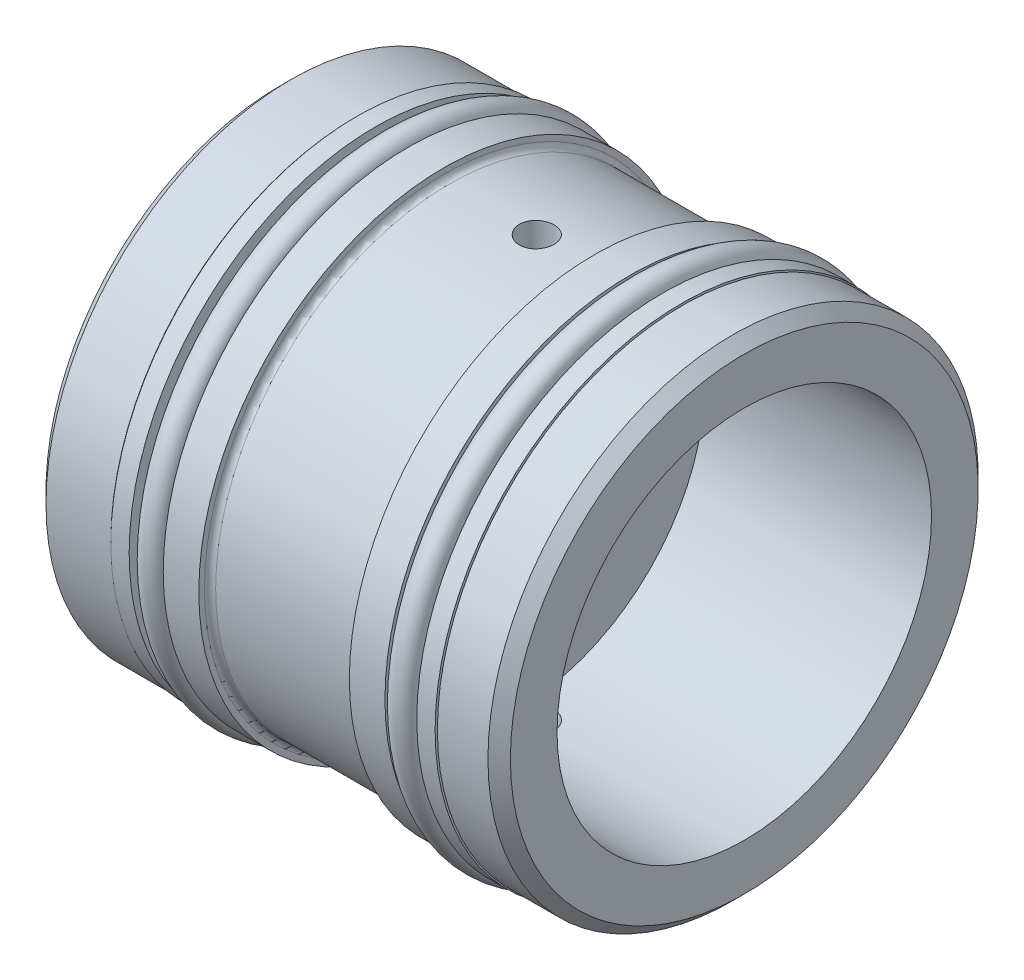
ISO-10303-21;
HEADER;
FILE_DESCRIPTION(('STEP AP214'),'2;1');
FILE_NAME('part.step','',(''),(''),'','','');
FILE_SCHEMA(('AUTOMOTIVE_DESIGN { 1 0 10303 214 1 1 1 1 }'));
ENDSEC;
DATA;
#1=APPLICATION_CONTEXT('core data for automotive mechanical design processes');
#2=APPLICATION_PROTOCOL_DEFINITION('international standard','automotive_design',2000,#1);
#3=PRODUCT_CONTEXT('',#1,'mechanical');
#4=PRODUCT('Part','Part','',(#3));
#5=PRODUCT_RELATED_PRODUCT_CATEGORY('part','',(#4));
#6=PRODUCT_DEFINITION_FORMATION('','',#4);
#7=PRODUCT_DEFINITION_CONTEXT('part definition',#1,'design');
#8=PRODUCT_DEFINITION('design','',#6,#7);
#9=PRODUCT_DEFINITION_SHAPE('','',#8);
#10=(LENGTH_UNIT() NAMED_UNIT(*) SI_UNIT(.MILLI.,.METRE.));
#11=(NAMED_UNIT(*) PLANE_ANGLE_UNIT() SI_UNIT($,.RADIAN.));
#12=(NAMED_UNIT(*) SI_UNIT($,.STERADIAN.) SOLID_ANGLE_UNIT());
#13=UNCERTAINTY_MEASURE_WITH_UNIT(LENGTH_MEASURE(1.E-05),#10,'distance_accuracy_value','');
#14=(GEOMETRIC_REPRESENTATION_CONTEXT(3) GLOBAL_UNCERTAINTY_ASSIGNED_CONTEXT((#13)) GLOBAL_UNIT_ASSIGNED_CONTEXT((#10,
#11,#12)) REPRESENTATION_CONTEXT('',''));
#15=CARTESIAN_POINT('',(0.,0.,0.));
#16=DIRECTION('',(0.,0.,1.));
#17=DIRECTION('',(1.,0.,0.));
#18=AXIS2_PLACEMENT_3D('',#15,#16,#17);
#19=CARTESIAN_POINT('',(0.,0.,0.));
#20=DIRECTION('',(-1.,0.,0.));
#21=DIRECTION('',(0.,0.,1.));
#22=AXIS2_PLACEMENT_3D('',#19,#20,#21);
#23=CYLINDRICAL_SURFACE('',#22,15.3543);
#24=CARTESIAN_POINT('',(9.32630715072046,0.,0.));
#25=DIRECTION('',(-1.,0.,0.));
#26=DIRECTION('',(0.,0.,1.));
#27=AXIS2_PLACEMENT_3D('',#24,#25,#26);
#28=CIRCLE('',#27,15.3543);
#29=CARTESIAN_POINT('',(9.32630715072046,0.,15.3543));
#30=VERTEX_POINT('',#29);
#31=EDGE_CURVE('E146',#30,#30,#28,.T.);
#32=ORIENTED_EDGE('',*,*,#31,.F.);
#33=EDGE_LOOP('',(#32));
#34=FACE_BOUND('',#33,.T.);
#35=CARTESIAN_POINT('',(10.2362,0.,0.));
#36=DIRECTION('',(1.,0.,0.));
#37=DIRECTION('',(0.,0.,-1.));
#38=AXIS2_PLACEMENT_3D('',#35,#36,#37);
#39=CIRCLE('',#38,15.3543);
#40=CARTESIAN_POINT('',(10.2362,0.,-15.3543));
#41=VERTEX_POINT('',#40);
#42=EDGE_CURVE('E10',#41,#41,#39,.T.);
#43=ORIENTED_EDGE('',*,*,#42,.F.);
#44=EDGE_LOOP('',(#43));
#45=FACE_BOUND('',#44,.T.);
#46=ADVANCED_FACE('F31',(#34,#45),#23,.T.);
#47=CARTESIAN_POINT('',(11.557,0.,0.));
#48=DIRECTION('',(-1.,0.,0.));
#49=DIRECTION('',(0.,0.,1.));
#50=AXIS2_PLACEMENT_3D('',#47,#48,#49);
#51=CIRCLE('',#50,15.3543);
#52=CARTESIAN_POINT('',(11.557,0.,15.3543));
#53=VERTEX_POINT('',#52);
#54=EDGE_CURVE('E198',#53,#53,#51,.T.);
#55=ORIENTED_EDGE('',*,*,#54,.T.);
#56=EDGE_LOOP('',(#55));
#57=FACE_BOUND('',#56,.T.);
#58=CARTESIAN_POINT('',(11.4808,0.,0.));
#59=DIRECTION('',(-1.,0.,0.));
#60=DIRECTION('',(0.,0.,1.));
#61=AXIS2_PLACEMENT_3D('',#58,#59,#60);
#62=CIRCLE('',#61,15.3543);
#63=CARTESIAN_POINT('',(11.4808,0.,15.3543));
#64=VERTEX_POINT('',#63);
#65=EDGE_CURVE('E43',#64,#64,#62,.T.);
#66=ORIENTED_EDGE('',*,*,#65,.F.);
#67=EDGE_LOOP('',(#66));
#68=FACE_BOUND('',#67,.T.);
#69=ADVANCED_FACE('F118',(#57,#68),#23,.T.);
#70=CARTESIAN_POINT('',(8.001,0.,0.));
#71=DIRECTION('',(-1.,0.,0.));
#72=DIRECTION('',(0.,0.,1.));
#73=AXIS2_PLACEMENT_3D('',#70,#71,#72);
#74=CIRCLE('',#73,15.3543);
#75=CARTESIAN_POINT('',(8.001,0.,15.3543));
#76=VERTEX_POINT('',#75);
#77=EDGE_CURVE('E142',#76,#76,#74,.T.);
#78=ORIENTED_EDGE('',*,*,#77,.F.);
#79=EDGE_LOOP('',(#78));
#80=FACE_BOUND('',#79,.T.);
#81=CARTESIAN_POINT('',(8.60609284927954,0.,0.));
#82=DIRECTION('',(1.,0.,0.));
#83=DIRECTION('',(0.,0.,-1.));
#84=AXIS2_PLACEMENT_3D('',#81,#82,#83);
#85=CIRCLE('',#84,15.3543);
#86=CARTESIAN_POINT('',(8.60609284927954,0.,-15.3543));
#87=VERTEX_POINT('',#86);
#88=EDGE_CURVE('E48',#87,#87,#85,.T.);
#89=ORIENTED_EDGE('',*,*,#88,.F.);
#90=EDGE_LOOP('',(#89));
#91=FACE_BOUND('',#90,.T.);
#92=ADVANCED_FACE('F121',(#80,#91),#23,.T.);
#93=CARTESIAN_POINT('',(0.,0.,0.));
#94=DIRECTION('',(-1.,0.,0.));
#95=DIRECTION('',(0.,0.,1.));
#96=AXIS2_PLACEMENT_3D('',#93,#94,#95);
#97=CYLINDRICAL_SURFACE('',#96,15.3543);
#98=CARTESIAN_POINT('',(-9.271,0.,0.));
#99=DIRECTION('',(-1.,0.,0.));
#100=DIRECTION('',(0.,0.,1.));
#101=AXIS2_PLACEMENT_3D('',#98,#99,#100);
#102=CIRCLE('',#101,15.3543);
#103=CARTESIAN_POINT('',(-9.271,0.,15.3543));
#104=VERTEX_POINT('',#103);
#105=EDGE_CURVE('E159',#104,#104,#102,.T.);
#106=ORIENTED_EDGE('',*,*,#105,.F.);
#107=EDGE_LOOP('',(#106));
#108=FACE_BOUND('',#107,.T.);
#109=CARTESIAN_POINT('',(-8.36110715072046,0.,0.));
#110=DIRECTION('',(1.,0.,0.));
#111=DIRECTION('',(0.,0.,-1.));
#112=AXIS2_PLACEMENT_3D('',#109,#110,#111);
#113=CIRCLE('',#112,15.3543);
#114=CARTESIAN_POINT('',(-8.36110715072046,0.,-15.3543));
#115=VERTEX_POINT('',#114);
#116=EDGE_CURVE('E148',#115,#115,#113,.T.);
#117=ORIENTED_EDGE('',*,*,#116,.F.);
#118=EDGE_LOOP('',(#117));
#119=FACE_BOUND('',#118,.T.);
#120=ADVANCED_FACE('F131',(#108,#119),#97,.T.);
#121=CARTESIAN_POINT('',(-7.0358,0.,0.));
#122=DIRECTION('',(-1.,0.,0.));
#123=DIRECTION('',(0.,0.,1.));
#124=AXIS2_PLACEMENT_3D('',#121,#122,#123);
#125=CIRCLE('',#124,15.3543);
#126=CARTESIAN_POINT('',(-7.0358,0.,15.3543));
#127=VERTEX_POINT('',#126);
#128=EDGE_CURVE('E214',#127,#127,#125,.T.);
#129=ORIENTED_EDGE('',*,*,#128,.T.);
#130=EDGE_LOOP('',(#129));
#131=FACE_BOUND('',#130,.T.);
#132=CARTESIAN_POINT('',(-7.64089284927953,0.,0.));
#133=DIRECTION('',(-1.,0.,0.));
#134=DIRECTION('',(0.,0.,1.));
#135=AXIS2_PLACEMENT_3D('',#132,#133,#134);
#136=CIRCLE('',#135,15.3543);
#137=CARTESIAN_POINT('',(-7.64089284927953,0.,15.3543));
#138=VERTEX_POINT('',#137);
#139=EDGE_CURVE('E153',#138,#138,#136,.T.);
#140=ORIENTED_EDGE('',*,*,#139,.F.);
#141=EDGE_LOOP('',(#140));
#142=FACE_BOUND('',#141,.T.);
#143=ADVANCED_FACE('F136',(#131,#142),#97,.T.);
#144=CARTESIAN_POINT('',(-10.5918,0.,0.));
#145=DIRECTION('',(-1.,0.,0.));
#146=DIRECTION('',(0.,0.,1.));
#147=AXIS2_PLACEMENT_3D('',#144,#145,#146);
#148=CIRCLE('',#147,15.3543);
#149=CARTESIAN_POINT('',(-10.5918,0.,15.3543));
#150=VERTEX_POINT('',#149);
#151=EDGE_CURVE('E217',#150,#150,#148,.T.);
#152=ORIENTED_EDGE('',*,*,#151,.F.);
#153=EDGE_LOOP('',(#152));
#154=FACE_BOUND('',#153,.T.);
#155=CARTESIAN_POINT('',(-10.5156,0.,0.));
#156=DIRECTION('',(1.,0.,0.));
#157=DIRECTION('',(0.,0.,-1.));
#158=AXIS2_PLACEMENT_3D('',#155,#156,#157);
#159=CIRCLE('',#158,15.3543);
#160=CARTESIAN_POINT('',(-10.5156,0.,-15.3543));
#161=VERTEX_POINT('',#160);
#162=EDGE_CURVE('E156',#161,#161,#159,.T.);
#163=ORIENTED_EDGE('',*,*,#162,.F.);
#164=EDGE_LOOP('',(#163));
#165=FACE_BOUND('',#164,.T.);
#166=ADVANCED_FACE('F97',(#154,#165),#97,.T.);
#167=CARTESIAN_POINT('',(0.,0.,0.));
#168=DIRECTION('',(-1.,0.,0.));
#169=DIRECTION('',(0.,0.,1.));
#170=AXIS2_PLACEMENT_3D('',#167,#168,#169);
#171=CYLINDRICAL_SURFACE('',#170,6.35);
#172=CARTESIAN_POINT('',(0.355599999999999,0.,0.));
#173=DIRECTION('',(-1.,0.,0.));
#174=DIRECTION('',(0.,0.,1.));
#175=AXIS2_PLACEMENT_3D('',#172,#173,#174);
#176=CIRCLE('',#175,6.35);
#177=CARTESIAN_POINT('',(0.355599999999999,0.,6.35));
#178=VERTEX_POINT('',#177);
#179=EDGE_CURVE('E186',#178,#178,#176,.T.);
#180=ORIENTED_EDGE('',*,*,#179,.F.);
#181=EDGE_LOOP('',(#180));
#182=FACE_BOUND('',#181,.T.);
#183=CARTESIAN_POINT('',(-15.748,0.,0.));
#184=DIRECTION('',(-1.,0.,0.));
#185=DIRECTION('',(0.,0.,1.));
#186=AXIS2_PLACEMENT_3D('',#183,#184,#185);
#187=CIRCLE('',#186,6.35);
#188=CARTESIAN_POINT('',(-15.748,0.,6.35));
#189=VERTEX_POINT('',#188);
#190=EDGE_CURVE('E223',#189,#189,#187,.T.);
#191=ORIENTED_EDGE('',*,*,#190,.T.);
#192=EDGE_LOOP('',(#191));
#193=FACE_BOUND('',#192,.T.);
#194=ADVANCED_FACE('F93',(#182,#193),#171,.F.);
#195=CARTESIAN_POINT('',(0.355599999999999,6.35,0.));
#196=DIRECTION('',(-1.,0.,0.));
#197=DIRECTION('',(0.,0.,1.));
#198=AXIS2_PLACEMENT_3D('',#195,#196,#197);
#199=PLANE('',#198);
#200=CARTESIAN_POINT('',(0.355599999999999,0.,0.));
#201=DIRECTION('',(-1.,0.,0.));
#202=DIRECTION('',(0.,0.,1.));
#203=AXIS2_PLACEMENT_3D('',#200,#201,#202);
#204=CIRCLE('',#203,12.7);
#205=CARTESIAN_POINT('',(0.355599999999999,0.,12.7));
#206=VERTEX_POINT('',#205);
#207=EDGE_CURVE('E189',#206,#206,#204,.T.);
#208=ORIENTED_EDGE('',*,*,#207,.F.);
#209=EDGE_LOOP('',(#208));
#210=FACE_BOUND('',#209,.T.);
#211=ORIENTED_EDGE('',*,*,#179,.T.);
#212=EDGE_LOOP('',(#211));
#213=FACE_BOUND('',#212,.T.);
#214=ADVANCED_FACE('F87',(#210,#213),#199,.F.);
#215=CARTESIAN_POINT('',(0.,0.,0.));
#216=DIRECTION('',(-1.,0.,0.));
#217=DIRECTION('',(0.,0.,1.));
#218=AXIS2_PLACEMENT_3D('',#215,#216,#217);
#219=CYLINDRICAL_SURFACE('',#218,12.7);
#220=CARTESIAN_POINT('',(1.6764,-12.644959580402,1.1811));
#221=CARTESIAN_POINT('',(1.61021118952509,-12.6449603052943,1.18109712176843));
#222=CARTESIAN_POINT('',(1.54397804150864,-12.6454848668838,1.17551744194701));
#223=CARTESIAN_POINT('',(1.41334642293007,-12.6475262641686,1.15334235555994));
#224=CARTESIAN_POINT('',(1.34895008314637,-12.6490442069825,1.13673465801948));
#225=CARTESIAN_POINT('',(1.22390284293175,-12.6528989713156,1.09298985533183));
#226=CARTESIAN_POINT('',(1.1632497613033,-12.6552353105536,1.06585895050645));
#227=CARTESIAN_POINT('',(1.0473720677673,-12.6604630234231,1.0018494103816));
#228=CARTESIAN_POINT('',(0.992146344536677,-12.6633542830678,0.964972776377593));
#229=CARTESIAN_POINT('',(0.88850261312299,-12.6693763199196,0.882392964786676));
#230=CARTESIAN_POINT('',(0.840104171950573,-12.6725077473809,0.836665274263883));
#231=CARTESIAN_POINT('',(0.751657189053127,-12.6786513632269,0.737733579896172));
#232=CARTESIAN_POINT('',(0.711609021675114,-12.6816635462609,0.684529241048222));
#233=CARTESIAN_POINT('',(0.640932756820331,-12.687235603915,0.572035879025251));
#234=CARTESIAN_POINT('',(0.610321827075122,-12.6897946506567,0.512736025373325));
#235=CARTESIAN_POINT('',(0.559498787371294,-12.6941650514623,0.389810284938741));
#236=CARTESIAN_POINT('',(0.539286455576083,-12.6959764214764,0.326184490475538));
#237=CARTESIAN_POINT('',(0.509891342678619,-12.6986428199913,0.196609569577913));
#238=CARTESIAN_POINT('',(0.50067660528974,-12.6995006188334,0.130667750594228));
#239=CARTESIAN_POINT('',(0.493439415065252,-12.7001726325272,-0.00183171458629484));
#240=CARTESIAN_POINT('',(0.495416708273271,-12.6999868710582,-0.0683893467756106));
#241=CARTESIAN_POINT('',(0.510481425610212,-12.6985949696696,-0.200014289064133));
#242=CARTESIAN_POINT('',(0.523534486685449,-12.6973919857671,-0.265085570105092));
#243=CARTESIAN_POINT('',(0.560326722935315,-12.6941045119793,-0.392109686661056));
#244=CARTESIAN_POINT('',(0.584066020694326,-12.6920200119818,-0.454062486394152));
#245=CARTESIAN_POINT('',(0.641594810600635,-12.6871984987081,-0.573199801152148));
#246=CARTESIAN_POINT('',(0.675399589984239,-12.6844604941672,-0.630376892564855));
#247=CARTESIAN_POINT('',(0.752088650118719,-12.6786394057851,-0.738258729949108));
#248=CARTESIAN_POINT('',(0.794973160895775,-12.6755563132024,-0.788963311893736));
#249=CARTESIAN_POINT('',(0.888797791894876,-12.6693774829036,-0.882661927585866));
#250=CARTESIAN_POINT('',(0.939767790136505,-12.6662817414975,-0.925626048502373));
#251=CARTESIAN_POINT('',(1.04821271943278,-12.6604382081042,-1.00239277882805));
#252=CARTESIAN_POINT('',(1.1056876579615,-12.6576904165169,-1.03619537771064));
#253=CARTESIAN_POINT('',(1.2255330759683,-12.6528535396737,-1.09367894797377));
#254=CARTESIAN_POINT('',(1.28790438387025,-12.6507645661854,-1.11735820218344));
#255=CARTESIAN_POINT('',(1.41576128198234,-12.6474841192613,-1.15389991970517));
#256=CARTESIAN_POINT('',(1.48124679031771,-12.6462926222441,-1.16676266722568));
#257=CARTESIAN_POINT('',(1.61321097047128,-12.6449460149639,-1.18126803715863));
#258=CARTESIAN_POINT('',(1.67968501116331,-12.644787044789,-1.18295244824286));
#259=CARTESIAN_POINT('',(1.81196957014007,-12.6455133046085,-1.17516295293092));
#260=CARTESIAN_POINT('',(1.87778009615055,-12.6463985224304,-1.16568917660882));
#261=CARTESIAN_POINT('',(2.00674851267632,-12.6491099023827,-1.1358871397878));
#262=CARTESIAN_POINT('',(2.06991098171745,-12.6509343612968,-1.11557852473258));
#263=CARTESIAN_POINT('',(2.1919324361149,-12.655317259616,-1.0647033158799));
#264=CARTESIAN_POINT('',(2.25079133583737,-12.6578757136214,-1.03413651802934));
#265=CARTESIAN_POINT('',(2.36272567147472,-12.6634476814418,-0.963507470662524));
#266=CARTESIAN_POINT('',(2.41578352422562,-12.6664625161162,-0.923417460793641));
#267=CARTESIAN_POINT('',(2.51443160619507,-12.6726031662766,-0.834919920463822));
#268=CARTESIAN_POINT('',(2.56002167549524,-12.6757289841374,-0.786512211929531));
#269=CARTESIAN_POINT('',(2.64258351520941,-12.6817509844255,-0.682572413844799));
#270=CARTESIAN_POINT('',(2.67952807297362,-12.6846464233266,-0.627018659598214));
#271=CARTESIAN_POINT('',(2.74356315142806,-12.6898706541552,-0.510471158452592));
#272=CARTESIAN_POINT('',(2.77065379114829,-12.6921994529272,-0.449477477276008));
#273=CARTESIAN_POINT('',(2.81416564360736,-12.6960246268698,-0.323877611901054));
#274=CARTESIAN_POINT('',(2.83060346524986,-12.6975222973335,-0.25927722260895));
#275=CARTESIAN_POINT('',(2.85239731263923,-12.6995217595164,-0.1282188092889));
#276=CARTESIAN_POINT('',(2.85775360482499,-12.7000235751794,-0.0617608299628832));
#277=CARTESIAN_POINT('',(2.85722888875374,-12.6999747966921,0.0708585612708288));
#278=CARTESIAN_POINT('',(2.85139019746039,-12.6994281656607,0.137020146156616));
#279=CARTESIAN_POINT('',(2.82872977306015,-12.6973517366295,0.267418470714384));
#280=CARTESIAN_POINT('',(2.81190802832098,-12.6958219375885,0.331655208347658));
#281=CARTESIAN_POINT('',(2.76777031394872,-12.6919506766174,0.456381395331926));
#282=CARTESIAN_POINT('',(2.74045537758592,-12.6896092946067,0.516871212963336));
#283=CARTESIAN_POINT('',(2.67611127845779,-12.6843762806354,0.632413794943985));
#284=CARTESIAN_POINT('',(2.63908221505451,-12.6814846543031,0.687466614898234));
#285=CARTESIAN_POINT('',(2.5562020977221,-12.675462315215,0.79078926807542));
#286=CARTESIAN_POINT('',(2.51031959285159,-12.6723307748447,0.839033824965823));
#287=CARTESIAN_POINT('',(2.41109523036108,-12.6661885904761,0.927158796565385));
#288=CARTESIAN_POINT('',(2.35775157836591,-12.6631779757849,0.967037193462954));
#289=CARTESIAN_POINT('',(2.24499082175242,-12.6576112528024,1.0373661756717));
#290=CARTESIAN_POINT('',(2.18556036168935,-12.6550561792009,1.06779541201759));
#291=CARTESIAN_POINT('',(2.06244889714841,-12.650702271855,1.11820304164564));
#292=CARTESIAN_POINT('',(1.99877282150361,-12.6489025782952,1.13819332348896));
#293=CARTESIAN_POINT('',(1.89167449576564,-12.6467210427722,1.16212349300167));
#294=CARTESIAN_POINT('',(1.84893882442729,-12.6460635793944,1.16923007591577));
#295=CARTESIAN_POINT('',(1.76294175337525,-12.6451826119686,1.1787192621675));
#296=CARTESIAN_POINT('',(1.71968035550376,-12.6449591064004,1.18110188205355));
#297=CARTESIAN_POINT('',(1.6764,-12.644959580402,1.1811));
#298=B_SPLINE_CURVE_WITH_KNOTS('',3,(#220,#221,#222,#223,#224,#225,#226,#227,#228,#229,#230,
#231,#232,#233,#234,#235,#236,#237,#238,#239,#240,#241,#242,#243,#244,#245,#246,#247,#248,#249,
#250,#251,#252,#253,#254,#255,#256,#257,#258,#259,#260,#261,#262,#263,#264,#265,#266,#267,#268,
#269,#270,#271,#272,#273,#274,#275,#276,#277,#278,#279,#280,#281,#282,#283,#284,#285,#286,#287,
#288,#289,#290,#291,#292,#293,#294,#295,#296,#297),.UNSPECIFIED.,.T.,.F.,(4,2,2,2,2,2,2,2,2,2,2,
2,2,2,2,2,2,2,2,2,2,2,2,2,2,2,2,2,2,2,2,2,2,2,2,2,2,2,4),(0.,0.198408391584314,
0.397038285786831,0.595551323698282,0.794023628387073,0.993053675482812,1.19209264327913,
1.39149158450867,1.5908862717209,1.78970014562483,1.98850950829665,2.18670430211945,
2.38490136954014,2.58340100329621,2.78190566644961,2.98116171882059,3.18041800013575,
3.37970806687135,3.57899289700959,3.7775323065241,3.97606940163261,4.17424773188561,
4.3724300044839,4.57119722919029,4.76996870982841,4.96935767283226,5.16874422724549,
5.36781916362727,5.56688931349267,5.76520846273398,5.96352782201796,6.16182765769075,
6.36012546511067,6.55914112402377,6.75820472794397,6.95771486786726,7.15699729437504,
7.28673547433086,7.41647319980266),.UNSPECIFIED.);
#299=CARTESIAN_POINT('',(1.6764,-12.644959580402,1.1811));
#300=VERTEX_POINT('',#299);
#301=EDGE_CURVE('E77',#300,#300,#298,.T.);
#302=ORIENTED_EDGE('',*,*,#301,.T.);
#303=EDGE_LOOP('',(#302));
#304=FACE_BOUND('',#303,.T.);
#305=CARTESIAN_POINT('',(1.6764,12.644959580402,1.1811));
#306=CARTESIAN_POINT('',(1.7425888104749,12.6449603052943,1.18109712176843));
#307=CARTESIAN_POINT('',(1.80882195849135,12.6454848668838,1.17551744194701));
#308=CARTESIAN_POINT('',(1.93945357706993,12.6475262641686,1.15334235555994));
#309=CARTESIAN_POINT('',(2.00384991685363,12.6490442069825,1.13673465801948));
#310=CARTESIAN_POINT('',(2.12889715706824,12.6528989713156,1.09298985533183));
#311=CARTESIAN_POINT('',(2.1895502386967,12.6552353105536,1.06585895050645));
#312=CARTESIAN_POINT('',(2.3054279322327,12.6604630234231,1.0018494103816));
#313=CARTESIAN_POINT('',(2.36065365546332,12.6633542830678,0.964972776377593));
#314=CARTESIAN_POINT('',(2.46429738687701,12.6693763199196,0.882392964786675));
#315=CARTESIAN_POINT('',(2.51269582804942,12.6725077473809,0.836665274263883));
#316=CARTESIAN_POINT('',(2.60114281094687,12.6786513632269,0.737733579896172));
#317=CARTESIAN_POINT('',(2.64119097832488,12.6816635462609,0.684529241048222));
#318=CARTESIAN_POINT('',(2.71186724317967,12.687235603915,0.572035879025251));
#319=CARTESIAN_POINT('',(2.74247817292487,12.6897946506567,0.512736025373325));
#320=CARTESIAN_POINT('',(2.7933012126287,12.6941650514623,0.38981028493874));
#321=CARTESIAN_POINT('',(2.81351354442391,12.6959764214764,0.326184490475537));
#322=CARTESIAN_POINT('',(2.84290865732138,12.6986428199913,0.196609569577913));
#323=CARTESIAN_POINT('',(2.85212339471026,12.6995006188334,0.130667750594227));
#324=CARTESIAN_POINT('',(2.85936058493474,12.7001726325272,-0.0018317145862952));
#325=CARTESIAN_POINT('',(2.85738329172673,12.6999868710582,-0.068389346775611));
#326=CARTESIAN_POINT('',(2.84231857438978,12.6985949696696,-0.200014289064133));
#327=CARTESIAN_POINT('',(2.82926551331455,12.6973919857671,-0.265085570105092));
#328=CARTESIAN_POINT('',(2.79247327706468,12.6941045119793,-0.392109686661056));
#329=CARTESIAN_POINT('',(2.76873397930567,12.6920200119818,-0.454062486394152));
#330=CARTESIAN_POINT('',(2.71120518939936,12.6871984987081,-0.573199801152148));
#331=CARTESIAN_POINT('',(2.67740041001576,12.6844604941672,-0.630376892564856));
#332=CARTESIAN_POINT('',(2.60071134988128,12.6786394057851,-0.738258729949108));
#333=CARTESIAN_POINT('',(2.55782683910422,12.6755563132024,-0.788963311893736));
#334=CARTESIAN_POINT('',(2.46400220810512,12.6693774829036,-0.882661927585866));
#335=CARTESIAN_POINT('',(2.41303220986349,12.6662817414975,-0.925626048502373));
#336=CARTESIAN_POINT('',(2.30458728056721,12.6604382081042,-1.00239277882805));
#337=CARTESIAN_POINT('',(2.2471123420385,12.6576904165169,-1.03619537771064));
#338=CARTESIAN_POINT('',(2.1272669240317,12.6528535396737,-1.09367894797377));
#339=CARTESIAN_POINT('',(2.06489561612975,12.6507645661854,-1.11735820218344));
#340=CARTESIAN_POINT('',(1.93703871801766,12.6474841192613,-1.15389991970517));
#341=CARTESIAN_POINT('',(1.87155320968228,12.6462926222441,-1.16676266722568));
#342=CARTESIAN_POINT('',(1.73958902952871,12.6449460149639,-1.18126803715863));
#343=CARTESIAN_POINT('',(1.67311498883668,12.644787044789,-1.18295244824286));
#344=CARTESIAN_POINT('',(1.54083042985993,12.6455133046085,-1.17516295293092));
#345=CARTESIAN_POINT('',(1.47501990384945,12.6463985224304,-1.16568917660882));
#346=CARTESIAN_POINT('',(1.34605148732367,12.6491099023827,-1.1358871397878));
#347=CARTESIAN_POINT('',(1.28288901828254,12.6509343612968,-1.11557852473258));
#348=CARTESIAN_POINT('',(1.1608675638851,12.655317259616,-1.0647033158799));
#349=CARTESIAN_POINT('',(1.10200866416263,12.6578757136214,-1.03413651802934));
#350=CARTESIAN_POINT('',(0.990074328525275,12.6634476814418,-0.963507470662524));
#351=CARTESIAN_POINT('',(0.937016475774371,12.6664625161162,-0.92341746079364));
#352=CARTESIAN_POINT('',(0.838368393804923,12.6726031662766,-0.834919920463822));
#353=CARTESIAN_POINT('',(0.792778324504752,12.6757289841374,-0.786512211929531));
#354=CARTESIAN_POINT('',(0.71021648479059,12.6817509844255,-0.682572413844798));
#355=CARTESIAN_POINT('',(0.67327192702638,12.6846464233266,-0.627018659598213));
#356=CARTESIAN_POINT('',(0.609236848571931,12.6898706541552,-0.510471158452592));
#357=CARTESIAN_POINT('',(0.582146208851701,12.6921994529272,-0.449477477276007));
#358=CARTESIAN_POINT('',(0.538634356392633,12.6960246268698,-0.323877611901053));
#359=CARTESIAN_POINT('',(0.522196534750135,12.6975222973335,-0.259277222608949));
#360=CARTESIAN_POINT('',(0.50040268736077,12.6995217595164,-0.1282188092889));
#361=CARTESIAN_POINT('',(0.49504639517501,12.7000235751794,-0.0617608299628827));
#362=CARTESIAN_POINT('',(0.495571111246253,12.6999747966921,0.070858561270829));
#363=CARTESIAN_POINT('',(0.501409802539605,12.6994281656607,0.137020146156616));
#364=CARTESIAN_POINT('',(0.524070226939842,12.6973517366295,0.267418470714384));
#365=CARTESIAN_POINT('',(0.540891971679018,12.6958219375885,0.331655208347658));
#366=CARTESIAN_POINT('',(0.585029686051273,12.6919506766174,0.456381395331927));
#367=CARTESIAN_POINT('',(0.61234462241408,12.6896092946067,0.516871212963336));
#368=CARTESIAN_POINT('',(0.676688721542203,12.6843762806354,0.632413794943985));
#369=CARTESIAN_POINT('',(0.71371778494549,12.6814846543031,0.687466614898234));
#370=CARTESIAN_POINT('',(0.796597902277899,12.675462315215,0.79078926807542));
#371=CARTESIAN_POINT('',(0.842480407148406,12.6723307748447,0.839033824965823));
#372=CARTESIAN_POINT('',(0.941704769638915,12.6661885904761,0.927158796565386));
#373=CARTESIAN_POINT('',(0.995048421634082,12.6631779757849,0.967037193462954));
#374=CARTESIAN_POINT('',(1.10780917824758,12.6576112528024,1.0373661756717));
#375=CARTESIAN_POINT('',(1.16723963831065,12.6550561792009,1.06779541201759));
#376=CARTESIAN_POINT('',(1.29035110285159,12.650702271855,1.11820304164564));
#377=CARTESIAN_POINT('',(1.35402717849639,12.6489025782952,1.13819332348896));
#378=CARTESIAN_POINT('',(1.46112550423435,12.6467210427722,1.16212349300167));
#379=CARTESIAN_POINT('',(1.50386117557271,12.6460635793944,1.16923007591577));
#380=CARTESIAN_POINT('',(1.58985824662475,12.6451826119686,1.1787192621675));
#381=CARTESIAN_POINT('',(1.63311964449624,12.6449591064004,1.18110188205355));
#382=CARTESIAN_POINT('',(1.6764,12.644959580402,1.1811));
#383=B_SPLINE_CURVE_WITH_KNOTS('',3,(#305,#306,#307,#308,#309,#310,#311,#312,#313,#314,#315,
#316,#317,#318,#319,#320,#321,#322,#323,#324,#325,#326,#327,#328,#329,#330,#331,#332,#333,#334,
#335,#336,#337,#338,#339,#340,#341,#342,#343,#344,#345,#346,#347,#348,#349,#350,#351,#352,#353,
#354,#355,#356,#357,#358,#359,#360,#361,#362,#363,#364,#365,#366,#367,#368,#369,#370,#371,#372,
#373,#374,#375,#376,#377,#378,#379,#380,#381,#382),.UNSPECIFIED.,.T.,.F.,(4,2,2,2,2,2,2,2,2,2,2,
2,2,2,2,2,2,2,2,2,2,2,2,2,2,2,2,2,2,2,2,2,2,2,2,2,2,2,4),(0.,0.198408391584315,
0.397038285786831,0.595551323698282,0.794023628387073,0.993053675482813,1.19209264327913,
1.39149158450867,1.5908862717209,1.78970014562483,1.98850950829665,2.18670430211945,
2.38490136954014,2.58340100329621,2.78190566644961,2.98116171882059,3.18041800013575,
3.37970806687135,3.57899289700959,3.7775323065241,3.97606940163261,4.17424773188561,
4.3724300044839,4.57119722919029,4.76996870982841,4.96935767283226,5.16874422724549,
5.36781916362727,5.56688931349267,5.76520846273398,5.96352782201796,6.16182765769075,
6.36012546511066,6.55914112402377,6.75820472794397,6.95771486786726,7.15699729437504,
7.28673547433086,7.41647319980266),.UNSPECIFIED.);
#384=CARTESIAN_POINT('',(1.6764,12.644959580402,1.1811));
#385=VERTEX_POINT('',#384);
#386=EDGE_CURVE('E72',#385,#385,#383,.T.);
#387=ORIENTED_EDGE('',*,*,#386,.T.);
#388=EDGE_LOOP('',(#387));
#389=FACE_BOUND('',#388,.T.);
#390=CARTESIAN_POINT('',(15.748,0.,0.));
#391=DIRECTION('',(-1.,0.,0.));
#392=DIRECTION('',(0.,0.,1.));
#393=AXIS2_PLACEMENT_3D('',#390,#391,#392);
#394=CIRCLE('',#393,12.7);
#395=CARTESIAN_POINT('',(15.748,0.,12.7));
#396=VERTEX_POINT('',#395);
#397=EDGE_CURVE('E192',#396,#396,#394,.T.);
#398=ORIENTED_EDGE('',*,*,#397,.F.);
#399=EDGE_LOOP('',(#398));
#400=FACE_BOUND('',#399,.T.);
#401=ORIENTED_EDGE('',*,*,#207,.T.);
#402=EDGE_LOOP('',(#401));
#403=FACE_BOUND('',#402,.T.);
#404=ADVANCED_FACE('F81',(#304,#389,#400,#403),#219,.F.);
#405=CARTESIAN_POINT('',(15.748,16.6243,0.));
#406=DIRECTION('',(-1.,0.,0.));
#407=DIRECTION('',(0.,0.,1.));
#408=AXIS2_PLACEMENT_3D('',#405,#406,#407);
#409=PLANE('',#408);
#410=CARTESIAN_POINT('',(15.748,0.,0.));
#411=DIRECTION('',(-1.,0.,0.));
#412=DIRECTION('',(0.,0.,1.));
#413=AXIS2_PLACEMENT_3D('',#410,#411,#412);
#414=CIRCLE('',#413,15.8623);
#415=CARTESIAN_POINT('',(15.748,0.,15.8623));
#416=VERTEX_POINT('',#415);
#417=EDGE_CURVE('E168',#416,#416,#414,.F.);
#418=ORIENTED_EDGE('',*,*,#417,.T.);
#419=EDGE_LOOP('',(#418));
#420=FACE_BOUND('',#419,.T.);
#421=ORIENTED_EDGE('',*,*,#397,.T.);
#422=EDGE_LOOP('',(#421));
#423=FACE_BOUND('',#422,.T.);
#424=ADVANCED_FACE('F86',(#420,#423),#409,.F.);
#425=CARTESIAN_POINT('',(0.,0.,0.));
#426=DIRECTION('',(-1.,0.,0.));
#427=DIRECTION('',(0.,0.,1.));
#428=AXIS2_PLACEMENT_3D('',#425,#426,#427);
#429=CYLINDRICAL_SURFACE('',#428,16.6243);
#430=CARTESIAN_POINT('',(14.986,0.,0.));
#431=DIRECTION('',(-1.,0.,0.));
#432=DIRECTION('',(0.,0.,1.));
#433=AXIS2_PLACEMENT_3D('',#430,#431,#432);
#434=CIRCLE('',#433,16.6243);
#435=CARTESIAN_POINT('',(14.986,0.,16.6243));
#436=VERTEX_POINT('',#435);
#437=EDGE_CURVE('E171',#436,#436,#434,.T.);
#438=ORIENTED_EDGE('',*,*,#437,.T.);
#439=EDGE_LOOP('',(#438));
#440=FACE_BOUND('',#439,.T.);
#441=CARTESIAN_POINT('',(11.557,0.,0.));
#442=DIRECTION('',(-1.,0.,0.));
#443=DIRECTION('',(0.,0.,1.));
#444=AXIS2_PLACEMENT_3D('',#441,#442,#443);
#445=CIRCLE('',#444,16.6243);
#446=CARTESIAN_POINT('',(11.557,0.,16.6243));
#447=VERTEX_POINT('',#446);
#448=EDGE_CURVE('E195',#447,#447,#445,.T.);
#449=ORIENTED_EDGE('',*,*,#448,.F.);
#450=EDGE_LOOP('',(#449));
#451=FACE_BOUND('',#450,.T.);
#452=ADVANCED_FACE('F418',(#440,#451),#429,.T.);
#453=CARTESIAN_POINT('',(11.557,16.6243,0.));
#454=DIRECTION('',(1.,0.,0.));
#455=DIRECTION('',(0.,0.,-1.));
#456=AXIS2_PLACEMENT_3D('',#453,#454,#455);
#457=PLANE('',#456);
#458=ORIENTED_EDGE('',*,*,#54,.F.);
#459=EDGE_LOOP('',(#458));
#460=FACE_BOUND('',#459,.T.);
#461=ORIENTED_EDGE('',*,*,#448,.T.);
#462=EDGE_LOOP('',(#461));
#463=FACE_BOUND('',#462,.T.);
#464=ADVANCED_FACE('F426',(#460,#463),#457,.F.);
#465=CARTESIAN_POINT('',(8.001,15.3543,0.));
#466=DIRECTION('',(-1.,0.,0.));
#467=DIRECTION('',(0.,0.,1.));
#468=AXIS2_PLACEMENT_3D('',#465,#466,#467);
#469=PLANE('',#468);
#470=CARTESIAN_POINT('',(8.001,0.,0.));
#471=DIRECTION('',(-1.,0.,0.));
#472=DIRECTION('',(0.,0.,1.));
#473=AXIS2_PLACEMENT_3D('',#470,#471,#472);
#474=CIRCLE('',#473,16.6243);
#475=CARTESIAN_POINT('',(8.001,0.,16.6243));
#476=VERTEX_POINT('',#475);
#477=EDGE_CURVE('E202',#476,#476,#474,.T.);
#478=ORIENTED_EDGE('',*,*,#477,.F.);
#479=EDGE_LOOP('',(#478));
#480=FACE_BOUND('',#479,.T.);
#481=ORIENTED_EDGE('',*,*,#77,.T.);
#482=EDGE_LOOP('',(#481));
#483=FACE_BOUND('',#482,.T.);
#484=ADVANCED_FACE('F433',(#480,#483),#469,.F.);
#485=CARTESIAN_POINT('',(0.,0.,0.));
#486=DIRECTION('',(-1.,0.,0.));
#487=DIRECTION('',(0.,0.,1.));
#488=AXIS2_PLACEMENT_3D('',#485,#486,#487);
#489=CYLINDRICAL_SURFACE('',#488,16.6243);
#490=CARTESIAN_POINT('',(5.588,0.,0.));
#491=DIRECTION('',(-1.,0.,0.));
#492=DIRECTION('',(0.,0.,1.));
#493=AXIS2_PLACEMENT_3D('',#490,#491,#492);
#494=CIRCLE('',#493,16.6243);
#495=CARTESIAN_POINT('',(5.588,0.,16.6243));
#496=VERTEX_POINT('',#495);
#497=EDGE_CURVE('E205',#496,#496,#494,.T.);
#498=ORIENTED_EDGE('',*,*,#497,.F.);
#499=EDGE_LOOP('',(#498));
#500=FACE_BOUND('',#499,.T.);
#501=ORIENTED_EDGE('',*,*,#477,.T.);
#502=EDGE_LOOP('',(#501));
#503=FACE_BOUND('',#502,.T.);
#504=ADVANCED_FACE('F293',(#500,#503),#489,.T.);
#505=CARTESIAN_POINT('',(5.588,16.6243,0.));
#506=DIRECTION('',(1.,0.,0.));
#507=DIRECTION('',(0.,0.,-1.));
#508=AXIS2_PLACEMENT_3D('',#505,#506,#507);
#509=PLANE('',#508);
#510=CARTESIAN_POINT('',(5.588,0.,0.));
#511=DIRECTION('',(1.,0.,0.));
#512=DIRECTION('',(0.,0.,-1.));
#513=AXIS2_PLACEMENT_3D('',#510,#511,#512);
#514=CIRCLE('',#513,16.2433);
#515=CARTESIAN_POINT('',(5.588,0.,-16.2433));
#516=VERTEX_POINT('',#515);
#517=EDGE_CURVE('E177',#516,#516,#514,.T.);
#518=ORIENTED_EDGE('',*,*,#517,.T.);
#519=EDGE_LOOP('',(#518));
#520=FACE_BOUND('',#519,.T.);
#521=ORIENTED_EDGE('',*,*,#497,.T.);
#522=EDGE_LOOP('',(#521));
#523=FACE_BOUND('',#522,.T.);
#524=ADVANCED_FACE('F283',(#520,#523),#509,.F.);
#525=CARTESIAN_POINT('',(0.,0.,0.));
#526=DIRECTION('',(-1.,0.,0.));
#527=DIRECTION('',(0.,0.,1.));
#528=AXIS2_PLACEMENT_3D('',#525,#526,#527);
#529=CYLINDRICAL_SURFACE('',#528,15.8623);
#530=CARTESIAN_POINT('',(1.6764,-15.8182667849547,1.1811));
#531=CARTESIAN_POINT('',(1.74264416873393,-15.8182673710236,1.18109709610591));
#532=CARTESIAN_POINT('',(1.8089340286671,-15.8186873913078,1.17550812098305));
#533=CARTESIAN_POINT('',(1.93968131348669,-15.8203221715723,1.15329394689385));
#534=CARTESIAN_POINT('',(2.00413654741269,-15.8215378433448,1.13665608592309));
#535=CARTESIAN_POINT('',(2.12930188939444,-15.8246254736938,1.09282647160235));
#536=CARTESIAN_POINT('',(2.19001403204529,-15.8264970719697,1.06564051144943));
#537=CARTESIAN_POINT('',(2.30599821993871,-15.8306852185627,1.00149629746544));
#538=CARTESIAN_POINT('',(2.36127146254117,-15.8330016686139,0.964540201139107));
#539=CARTESIAN_POINT('',(2.46493873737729,-15.8378239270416,0.881821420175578));
#540=CARTESIAN_POINT('',(2.51331993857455,-15.8403300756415,0.836042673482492));
#541=CARTESIAN_POINT('',(2.60171969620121,-15.8452462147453,0.73701177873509));
#542=CARTESIAN_POINT('',(2.64173789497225,-15.8476562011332,0.683759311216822));
#543=CARTESIAN_POINT('',(2.71231713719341,-15.8521115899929,0.571217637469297));
#544=CARTESIAN_POINT('',(2.74286726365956,-15.8541565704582,0.511921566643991));
#545=CARTESIAN_POINT('',(2.79357330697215,-15.8576478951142,0.389023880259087));
#546=CARTESIAN_POINT('',(2.81372937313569,-15.8590942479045,0.325422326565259));
#547=CARTESIAN_POINT('',(2.84303871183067,-15.8612229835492,0.195845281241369));
#548=CARTESIAN_POINT('',(2.85221249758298,-15.8619067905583,0.129874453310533));
#549=CARTESIAN_POINT('',(2.85936024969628,-15.8624382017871,-0.00267395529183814));
#550=CARTESIAN_POINT('',(2.85733438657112,-15.8622858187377,-0.0692515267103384));
#551=CARTESIAN_POINT('',(2.84215718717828,-15.8611632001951,-0.200984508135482));
#552=CARTESIAN_POINT('',(2.82902791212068,-15.8601945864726,-0.266142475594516));
#553=CARTESIAN_POINT('',(2.79205085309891,-15.8575503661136,-0.393327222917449));
#554=CARTESIAN_POINT('',(2.76820298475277,-15.8558747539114,-0.45535397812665));
#555=CARTESIAN_POINT('',(2.7104409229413,-15.8520023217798,-0.574586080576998));
#556=CARTESIAN_POINT('',(2.67651679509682,-15.849804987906,-0.631786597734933));
#557=CARTESIAN_POINT('',(2.59957241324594,-15.845136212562,-0.739689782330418));
#558=CARTESIAN_POINT('',(2.55655201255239,-15.8426647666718,-0.790392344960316));
#559=CARTESIAN_POINT('',(2.46251181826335,-15.8377186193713,-0.883989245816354));
#560=CARTESIAN_POINT('',(2.41147286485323,-15.835243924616,-0.926864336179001));
#561=CARTESIAN_POINT('',(2.30291130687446,-15.8305762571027,-1.00344066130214));
#562=CARTESIAN_POINT('',(2.24538869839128,-15.8283832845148,-1.03714189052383));
#563=CARTESIAN_POINT('',(2.12547975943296,-15.824526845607,-1.09441281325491));
#564=CARTESIAN_POINT('',(2.06309299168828,-15.8228634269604,-1.11798159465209));
#565=CARTESIAN_POINT('',(1.93523272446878,-15.820255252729,-1.15430478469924));
#566=CARTESIAN_POINT('',(1.86975927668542,-15.8193104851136,-1.16705937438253));
#567=CARTESIAN_POINT('',(1.73775238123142,-15.8182484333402,-1.1813679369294));
#568=CARTESIAN_POINT('',(1.67122185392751,-15.8181291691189,-1.18294871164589));
#569=CARTESIAN_POINT('',(1.53884156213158,-15.818726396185,-1.17493489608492));
#570=CARTESIAN_POINT('',(1.47299179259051,-15.8194428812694,-1.16534038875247));
#571=CARTESIAN_POINT('',(1.34391865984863,-15.8216290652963,-1.1352706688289));
#572=CARTESIAN_POINT('',(1.28069238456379,-15.8230979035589,-1.11480788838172));
#573=CARTESIAN_POINT('',(1.15857094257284,-15.8266225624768,-1.06359510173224));
#574=CARTESIAN_POINT('',(1.09967583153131,-15.8286783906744,-1.03284496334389));
#575=CARTESIAN_POINT('',(0.987765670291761,-15.8331501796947,-0.961862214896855));
#576=CARTESIAN_POINT('',(0.934762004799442,-15.8355668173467,-0.92161169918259));
#577=CARTESIAN_POINT('',(0.83625420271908,-15.8404855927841,-0.832796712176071));
#578=CARTESIAN_POINT('',(0.790750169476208,-15.8429877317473,-0.784232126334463));
#579=CARTESIAN_POINT('',(0.708442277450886,-15.8478014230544,-0.680051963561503));
#580=CARTESIAN_POINT('',(0.67165580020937,-15.8501125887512,-0.624422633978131));
#581=CARTESIAN_POINT('',(0.607946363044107,-15.8542783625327,-0.507760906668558));
#582=CARTESIAN_POINT('',(0.581023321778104,-15.8561329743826,-0.446728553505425));
#583=CARTESIAN_POINT('',(0.537835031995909,-15.8591748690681,-0.32105629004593));
#584=CARTESIAN_POINT('',(0.521558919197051,-15.8603628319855,-0.256420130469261));
#585=CARTESIAN_POINT('',(0.500090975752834,-15.8619403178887,-0.125323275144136));
#586=CARTESIAN_POINT('',(0.494898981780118,-15.8623298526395,-0.0588626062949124));
#587=CARTESIAN_POINT('',(0.495748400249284,-15.8622666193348,0.0738250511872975));
#588=CARTESIAN_POINT('',(0.501762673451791,-15.8618158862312,0.140052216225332));
#589=CARTESIAN_POINT('',(0.524797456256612,-15.8601268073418,0.270553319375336));
#590=CARTESIAN_POINT('',(0.541817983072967,-15.8588884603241,0.334827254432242));
#591=CARTESIAN_POINT('',(0.58637555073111,-15.8557632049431,0.459600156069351));
#592=CARTESIAN_POINT('',(0.613912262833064,-15.8538763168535,0.520099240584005));
#593=CARTESIAN_POINT('',(0.678717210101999,-15.849665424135,0.635619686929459));
#594=CARTESIAN_POINT('',(0.715985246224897,-15.8473414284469,0.690641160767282));
#595=CARTESIAN_POINT('',(0.799296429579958,-15.8425107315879,0.793783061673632));
#596=CARTESIAN_POINT('',(0.84535951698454,-15.8400036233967,0.841887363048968));
#597=CARTESIAN_POINT('',(0.944920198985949,-15.8350926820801,0.929699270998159));
#598=CARTESIAN_POINT('',(0.998419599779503,-15.8326888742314,0.969404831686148));
#599=CARTESIAN_POINT('',(1.11141818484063,-15.8282525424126,1.03933452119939));
#600=CARTESIAN_POINT('',(1.17092670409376,-15.8262206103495,1.06954358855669));
#601=CARTESIAN_POINT('',(1.29414457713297,-15.8227654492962,1.11950336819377));
#602=CARTESIAN_POINT('',(1.35784896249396,-15.8213415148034,1.13926620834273));
#603=CARTESIAN_POINT('',(1.46434643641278,-15.8196330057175,1.16269147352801));
#604=CARTESIAN_POINT('',(1.50645292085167,-15.8191229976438,1.16958561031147));
#605=CARTESIAN_POINT('',(1.59116663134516,-15.8184396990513,1.17879080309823));
#606=CARTESIAN_POINT('',(1.63377385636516,-15.8182664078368,1.1811018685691));
#607=CARTESIAN_POINT('',(1.6764,-15.8182667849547,1.1811));
#608=B_SPLINE_CURVE_WITH_KNOTS('',3,(#530,#531,#532,#533,#534,#535,#536,#537,#538,#539,#540,
#541,#542,#543,#544,#545,#546,#547,#548,#549,#550,#551,#552,#553,#554,#555,#556,#557,#558,#559,
#560,#561,#562,#563,#564,#565,#566,#567,#568,#569,#570,#571,#572,#573,#574,#575,#576,#577,#578,
#579,#580,#581,#582,#583,#584,#585,#586,#587,#588,#589,#590,#591,#592,#593,#594,#595,#596,#597,
#598,#599,#600,#601,#602,#603,#604,#605,#606,#607),.UNSPECIFIED.,.T.,.F.,(4,2,2,2,2,2,2,2,2,2,2,
2,2,2,2,2,2,2,2,2,2,2,2,2,2,2,2,2,2,2,2,2,2,2,2,2,2,2,4),(0.,0.198576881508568,
0.397381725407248,0.596077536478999,0.794729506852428,0.993746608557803,1.19277221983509,
1.39202646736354,1.59127785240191,1.79015648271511,1.98903208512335,2.18751347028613,
2.38599641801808,2.5846757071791,2.78335820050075,2.98252286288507,3.18168764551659,
3.38087035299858,3.58004972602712,3.7787511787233,3.97745115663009,4.17592433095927,
4.37440005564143,4.57325288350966,4.77210845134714,4.97135723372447,5.17060437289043,
5.36964787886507,5.56868845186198,5.76724761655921,5.96580709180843,6.16436036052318,
6.36290956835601,6.56191439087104,6.76096763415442,6.96033500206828,7.1594703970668,
7.28724895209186,7.41502724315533),.UNSPECIFIED.);
#609=CARTESIAN_POINT('',(1.6764,-15.8182667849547,1.1811));
#610=VERTEX_POINT('',#609);
#611=EDGE_CURVE('E35',#610,#610,#608,.T.);
#612=ORIENTED_EDGE('',*,*,#611,.T.);
#613=EDGE_LOOP('',(#612));
#614=FACE_BOUND('',#613,.T.);
#615=CARTESIAN_POINT('',(1.6764,15.8182667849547,1.1811));
#616=CARTESIAN_POINT('',(1.61015583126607,15.8182673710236,1.18109709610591));
#617=CARTESIAN_POINT('',(1.5438659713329,15.8186873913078,1.17550812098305));
#618=CARTESIAN_POINT('',(1.4131186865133,15.8203221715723,1.15329394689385));
#619=CARTESIAN_POINT('',(1.34866345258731,15.8215378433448,1.13665608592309));
#620=CARTESIAN_POINT('',(1.22349811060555,15.8246254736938,1.09282647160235));
#621=CARTESIAN_POINT('',(1.1627859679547,15.8264970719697,1.06564051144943));
#622=CARTESIAN_POINT('',(1.04680178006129,15.8306852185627,1.00149629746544));
#623=CARTESIAN_POINT('',(0.991528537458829,15.8330016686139,0.964540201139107));
#624=CARTESIAN_POINT('',(0.887861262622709,15.8378239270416,0.881821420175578));
#625=CARTESIAN_POINT('',(0.839480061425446,15.8403300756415,0.836042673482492));
#626=CARTESIAN_POINT('',(0.751080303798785,15.8452462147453,0.737011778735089));
#627=CARTESIAN_POINT('',(0.71106210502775,15.8476562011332,0.683759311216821));
#628=CARTESIAN_POINT('',(0.640482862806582,15.8521115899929,0.571217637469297));
#629=CARTESIAN_POINT('',(0.609932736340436,15.8541565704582,0.511921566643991));
#630=CARTESIAN_POINT('',(0.559226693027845,15.8576478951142,0.389023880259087));
#631=CARTESIAN_POINT('',(0.539070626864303,15.8590942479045,0.325422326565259));
#632=CARTESIAN_POINT('',(0.509761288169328,15.8612229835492,0.195845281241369));
#633=CARTESIAN_POINT('',(0.500587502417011,15.8619067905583,0.129874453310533));
#634=CARTESIAN_POINT('',(0.493439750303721,15.8624382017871,-0.00267395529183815));
#635=CARTESIAN_POINT('',(0.495465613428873,15.8622858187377,-0.0692515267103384));
#636=CARTESIAN_POINT('',(0.510642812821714,15.8611632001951,-0.200984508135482));
#637=CARTESIAN_POINT('',(0.523772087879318,15.8601945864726,-0.266142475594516));
#638=CARTESIAN_POINT('',(0.560749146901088,15.8575503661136,-0.393327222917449));
#639=CARTESIAN_POINT('',(0.584597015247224,15.8558747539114,-0.45535397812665));
#640=CARTESIAN_POINT('',(0.642359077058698,15.8520023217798,-0.574586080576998));
#641=CARTESIAN_POINT('',(0.676283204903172,15.849804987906,-0.631786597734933));
#642=CARTESIAN_POINT('',(0.753227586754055,15.845136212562,-0.739689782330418));
#643=CARTESIAN_POINT('',(0.796247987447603,15.8426647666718,-0.790392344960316));
#644=CARTESIAN_POINT('',(0.890288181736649,15.8377186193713,-0.883989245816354));
#645=CARTESIAN_POINT('',(0.941327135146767,15.835243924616,-0.926864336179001));
#646=CARTESIAN_POINT('',(1.04988869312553,15.8305762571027,-1.00344066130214));
#647=CARTESIAN_POINT('',(1.10741130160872,15.8283832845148,-1.03714189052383));
#648=CARTESIAN_POINT('',(1.22732024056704,15.824526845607,-1.09441281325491));
#649=CARTESIAN_POINT('',(1.28970700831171,15.8228634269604,-1.11798159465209));
#650=CARTESIAN_POINT('',(1.41756727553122,15.820255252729,-1.15430478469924));
#651=CARTESIAN_POINT('',(1.48304072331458,15.8193104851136,-1.16705937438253));
#652=CARTESIAN_POINT('',(1.61504761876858,15.8182484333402,-1.1813679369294));
#653=CARTESIAN_POINT('',(1.68157814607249,15.8181291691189,-1.18294871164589));
#654=CARTESIAN_POINT('',(1.81395843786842,15.818726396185,-1.17493489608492));
#655=CARTESIAN_POINT('',(1.87980820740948,15.8194428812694,-1.16534038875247));
#656=CARTESIAN_POINT('',(2.00888134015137,15.8216290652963,-1.1352706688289));
#657=CARTESIAN_POINT('',(2.07210761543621,15.8230979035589,-1.11480788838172));
#658=CARTESIAN_POINT('',(2.19422905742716,15.8266225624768,-1.06359510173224));
#659=CARTESIAN_POINT('',(2.25312416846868,15.8286783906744,-1.03284496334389));
#660=CARTESIAN_POINT('',(2.36503432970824,15.8331501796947,-0.961862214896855));
#661=CARTESIAN_POINT('',(2.41803799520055,15.8355668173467,-0.92161169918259));
#662=CARTESIAN_POINT('',(2.51654579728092,15.8404855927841,-0.832796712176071));
#663=CARTESIAN_POINT('',(2.56204983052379,15.8429877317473,-0.784232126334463));
#664=CARTESIAN_POINT('',(2.64435772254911,15.8478014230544,-0.680051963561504));
#665=CARTESIAN_POINT('',(2.68114419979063,15.8501125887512,-0.624422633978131));
#666=CARTESIAN_POINT('',(2.74485363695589,15.8542783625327,-0.507760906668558));
#667=CARTESIAN_POINT('',(2.77177667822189,15.8561329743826,-0.446728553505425));
#668=CARTESIAN_POINT('',(2.81496496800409,15.8591748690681,-0.32105629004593));
#669=CARTESIAN_POINT('',(2.83124108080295,15.8603628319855,-0.25642013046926));
#670=CARTESIAN_POINT('',(2.85270902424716,15.8619403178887,-0.125323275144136));
#671=CARTESIAN_POINT('',(2.85790101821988,15.8623298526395,-0.0588626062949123));
#672=CARTESIAN_POINT('',(2.85705159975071,15.8622666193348,0.0738250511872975));
#673=CARTESIAN_POINT('',(2.85103732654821,15.8618158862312,0.140052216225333));
#674=CARTESIAN_POINT('',(2.82800254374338,15.8601268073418,0.270553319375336));
#675=CARTESIAN_POINT('',(2.81098201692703,15.8588884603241,0.334827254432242));
#676=CARTESIAN_POINT('',(2.76642444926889,15.8557632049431,0.459600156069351));
#677=CARTESIAN_POINT('',(2.73888773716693,15.8538763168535,0.520099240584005));
#678=CARTESIAN_POINT('',(2.674082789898,15.849665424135,0.635619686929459));
#679=CARTESIAN_POINT('',(2.6368147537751,15.8473414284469,0.690641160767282));
#680=CARTESIAN_POINT('',(2.55350357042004,15.8425107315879,0.793783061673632));
#681=CARTESIAN_POINT('',(2.50744048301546,15.8400036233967,0.841887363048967));
#682=CARTESIAN_POINT('',(2.40787980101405,15.8350926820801,0.929699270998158));
#683=CARTESIAN_POINT('',(2.35438040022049,15.8326888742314,0.969404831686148));
#684=CARTESIAN_POINT('',(2.24138181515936,15.8282525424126,1.03933452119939));
#685=CARTESIAN_POINT('',(2.18187329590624,15.8262206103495,1.06954358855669));
#686=CARTESIAN_POINT('',(2.05865542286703,15.8227654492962,1.11950336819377));
#687=CARTESIAN_POINT('',(1.99495103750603,15.8213415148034,1.13926620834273));
#688=CARTESIAN_POINT('',(1.88845356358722,15.8196330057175,1.16269147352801));
#689=CARTESIAN_POINT('',(1.84634707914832,15.8191229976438,1.16958561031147));
#690=CARTESIAN_POINT('',(1.76163336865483,15.8184396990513,1.17879080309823));
#691=CARTESIAN_POINT('',(1.71902614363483,15.8182664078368,1.1811018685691));
#692=CARTESIAN_POINT('',(1.6764,15.8182667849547,1.1811));
#693=B_SPLINE_CURVE_WITH_KNOTS('',3,(#615,#616,#617,#618,#619,#620,#621,#622,#623,#624,#625,
#626,#627,#628,#629,#630,#631,#632,#633,#634,#635,#636,#637,#638,#639,#640,#641,#642,#643,#644,
#645,#646,#647,#648,#649,#650,#651,#652,#653,#654,#655,#656,#657,#658,#659,#660,#661,#662,#663,
#664,#665,#666,#667,#668,#669,#670,#671,#672,#673,#674,#675,#676,#677,#678,#679,#680,#681,#682,
#683,#684,#685,#686,#687,#688,#689,#690,#691,#692),.UNSPECIFIED.,.T.,.F.,(4,2,2,2,2,2,2,2,2,2,2,
2,2,2,2,2,2,2,2,2,2,2,2,2,2,2,2,2,2,2,2,2,2,2,2,2,2,2,4),(0.,0.198576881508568,
0.397381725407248,0.596077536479,0.794729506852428,0.993746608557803,1.19277221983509,
1.39202646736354,1.59127785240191,1.79015648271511,1.98903208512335,2.18751347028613,
2.38599641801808,2.5846757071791,2.78335820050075,2.98252286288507,3.18168764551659,
3.38087035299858,3.58004972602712,3.7787511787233,3.97745115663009,4.17592433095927,
4.37440005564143,4.57325288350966,4.77210845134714,4.97135723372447,5.17060437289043,
5.36964787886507,5.56868845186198,5.76724761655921,5.96580709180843,6.16436036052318,
6.36290956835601,6.56191439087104,6.76096763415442,6.96033500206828,7.1594703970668,
7.28724895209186,7.41502724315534),.UNSPECIFIED.);
#694=CARTESIAN_POINT('',(1.6764,15.8182667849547,1.1811));
#695=VERTEX_POINT('',#694);
#696=EDGE_CURVE('E51',#695,#695,#693,.T.);
#697=ORIENTED_EDGE('',*,*,#696,.T.);
#698=EDGE_LOOP('',(#697));
#699=FACE_BOUND('',#698,.T.);
#700=CARTESIAN_POINT('',(5.207,0.,0.));
#701=DIRECTION('',(1.,0.,0.));
#702=DIRECTION('',(0.,0.,-1.));
#703=AXIS2_PLACEMENT_3D('',#700,#701,#702);
#704=CIRCLE('',#703,15.8623);
#705=CARTESIAN_POINT('',(5.207,0.,-15.8623));
#706=VERTEX_POINT('',#705);
#707=EDGE_CURVE('E180',#706,#706,#704,.F.);
#708=ORIENTED_EDGE('',*,*,#707,.T.);
#709=EDGE_LOOP('',(#708));
#710=FACE_BOUND('',#709,.T.);
#711=CARTESIAN_POINT('',(-4.2418,0.,0.));
#712=DIRECTION('',(-1.,0.,0.));
#713=DIRECTION('',(0.,0.,1.));
#714=AXIS2_PLACEMENT_3D('',#711,#712,#713);
#715=CIRCLE('',#714,15.8623);
#716=CARTESIAN_POINT('',(-4.2418,0.,15.8623));
#717=VERTEX_POINT('',#716);
#718=EDGE_CURVE('E183',#717,#717,#715,.F.);
#719=ORIENTED_EDGE('',*,*,#718,.T.);
#720=EDGE_LOOP('',(#719));
#721=FACE_BOUND('',#720,.T.);
#722=ADVANCED_FACE('F55',(#614,#699,#710,#721),#529,.T.);
#723=CARTESIAN_POINT('',(-4.6228,16.6243,0.));
#724=DIRECTION('',(-1.,0.,0.));
#725=DIRECTION('',(0.,0.,1.));
#726=AXIS2_PLACEMENT_3D('',#723,#724,#725);
#727=PLANE('',#726);
#728=CARTESIAN_POINT('',(-4.6228,0.,0.));
#729=DIRECTION('',(-1.,0.,0.));
#730=DIRECTION('',(0.,0.,1.));
#731=AXIS2_PLACEMENT_3D('',#728,#729,#730);
#732=CIRCLE('',#731,16.2433);
#733=CARTESIAN_POINT('',(-4.6228,0.,16.2433));
#734=VERTEX_POINT('',#733);
#735=EDGE_CURVE('E174',#734,#734,#732,.T.);
#736=ORIENTED_EDGE('',*,*,#735,.T.);
#737=EDGE_LOOP('',(#736));
#738=FACE_BOUND('',#737,.T.);
#739=CARTESIAN_POINT('',(-4.6228,0.,0.));
#740=DIRECTION('',(-1.,0.,0.));
#741=DIRECTION('',(0.,0.,1.));
#742=AXIS2_PLACEMENT_3D('',#739,#740,#741);
#743=CIRCLE('',#742,16.6243);
#744=CARTESIAN_POINT('',(-4.6228,0.,16.6243));
#745=VERTEX_POINT('',#744);
#746=EDGE_CURVE('E208',#745,#745,#743,.T.);
#747=ORIENTED_EDGE('',*,*,#746,.F.);
#748=EDGE_LOOP('',(#747));
#749=FACE_BOUND('',#748,.T.);
#750=ADVANCED_FACE('F276',(#738,#749),#727,.F.);
#751=CARTESIAN_POINT('',(0.,0.,0.));
#752=DIRECTION('',(-1.,0.,0.));
#753=DIRECTION('',(0.,0.,1.));
#754=AXIS2_PLACEMENT_3D('',#751,#752,#753);
#755=CYLINDRICAL_SURFACE('',#754,16.6243);
#756=CARTESIAN_POINT('',(-7.0358,0.,0.));
#757=DIRECTION('',(-1.,0.,0.));
#758=DIRECTION('',(0.,0.,1.));
#759=AXIS2_PLACEMENT_3D('',#756,#757,#758);
#760=CIRCLE('',#759,16.6243);
#761=CARTESIAN_POINT('',(-7.0358,0.,16.6243));
#762=VERTEX_POINT('',#761);
#763=EDGE_CURVE('E211',#762,#762,#760,.T.);
#764=ORIENTED_EDGE('',*,*,#763,.F.);
#765=EDGE_LOOP('',(#764));
#766=FACE_BOUND('',#765,.T.);
#767=ORIENTED_EDGE('',*,*,#746,.T.);
#768=EDGE_LOOP('',(#767));
#769=FACE_BOUND('',#768,.T.);
#770=ADVANCED_FACE('F273',(#766,#769),#755,.T.);
#771=CARTESIAN_POINT('',(-7.0358,15.3543,0.));
#772=DIRECTION('',(1.,0.,0.));
#773=DIRECTION('',(0.,0.,-1.));
#774=AXIS2_PLACEMENT_3D('',#771,#772,#773);
#775=PLANE('',#774);
#776=ORIENTED_EDGE('',*,*,#128,.F.);
#777=EDGE_LOOP('',(#776));
#778=FACE_BOUND('',#777,.T.);
#779=ORIENTED_EDGE('',*,*,#763,.T.);
#780=EDGE_LOOP('',(#779));
#781=FACE_BOUND('',#780,.T.);
#782=ADVANCED_FACE('F266',(#778,#781),#775,.F.);
#783=CARTESIAN_POINT('',(-10.5918,16.6243,0.));
#784=DIRECTION('',(-1.,0.,0.));
#785=DIRECTION('',(0.,0.,1.));
#786=AXIS2_PLACEMENT_3D('',#783,#784,#785);
#787=PLANE('',#786);
#788=CARTESIAN_POINT('',(-10.5918,0.,0.));
#789=DIRECTION('',(-1.,0.,0.));
#790=DIRECTION('',(0.,0.,1.));
#791=AXIS2_PLACEMENT_3D('',#788,#789,#790);
#792=CIRCLE('',#791,16.6243);
#793=CARTESIAN_POINT('',(-10.5918,0.,16.6243));
#794=VERTEX_POINT('',#793);
#795=EDGE_CURVE('E220',#794,#794,#792,.T.);
#796=ORIENTED_EDGE('',*,*,#795,.F.);
#797=EDGE_LOOP('',(#796));
#798=FACE_BOUND('',#797,.T.);
#799=ORIENTED_EDGE('',*,*,#151,.T.);
#800=EDGE_LOOP('',(#799));
#801=FACE_BOUND('',#800,.T.);
#802=ADVANCED_FACE('F259',(#798,#801),#787,.F.);
#803=CARTESIAN_POINT('',(0.,0.,0.));
#804=DIRECTION('',(-1.,0.,0.));
#805=DIRECTION('',(0.,0.,1.));
#806=AXIS2_PLACEMENT_3D('',#803,#804,#805);
#807=CYLINDRICAL_SURFACE('',#806,16.6243);
#808=CARTESIAN_POINT('',(-14.986,0.,0.));
#809=DIRECTION('',(1.,0.,0.));
#810=DIRECTION('',(0.,0.,-1.));
#811=AXIS2_PLACEMENT_3D('',#808,#809,#810);
#812=CIRCLE('',#811,16.6243);
#813=CARTESIAN_POINT('',(-14.986,0.,-16.6243));
#814=VERTEX_POINT('',#813);
#815=EDGE_CURVE('E162',#814,#814,#812,.T.);
#816=ORIENTED_EDGE('',*,*,#815,.T.);
#817=EDGE_LOOP('',(#816));
#818=FACE_BOUND('',#817,.T.);
#819=ORIENTED_EDGE('',*,*,#795,.T.);
#820=EDGE_LOOP('',(#819));
#821=FACE_BOUND('',#820,.T.);
#822=ADVANCED_FACE('F253',(#818,#821),#807,.T.);
#823=CARTESIAN_POINT('',(-15.748,6.35,0.));
#824=DIRECTION('',(1.,0.,0.));
#825=DIRECTION('',(0.,0.,-1.));
#826=AXIS2_PLACEMENT_3D('',#823,#824,#825);
#827=PLANE('',#826);
#828=CARTESIAN_POINT('',(-15.748,0.,0.));
#829=DIRECTION('',(1.,0.,0.));
#830=DIRECTION('',(0.,0.,-1.));
#831=AXIS2_PLACEMENT_3D('',#828,#829,#830);
#832=CIRCLE('',#831,15.8623);
#833=CARTESIAN_POINT('',(-15.748,0.,-15.8623));
#834=VERTEX_POINT('',#833);
#835=EDGE_CURVE('E165',#834,#834,#832,.F.);
#836=ORIENTED_EDGE('',*,*,#835,.T.);
#837=EDGE_LOOP('',(#836));
#838=FACE_BOUND('',#837,.T.);
#839=ORIENTED_EDGE('',*,*,#190,.F.);
#840=EDGE_LOOP('',(#839));
#841=FACE_BOUND('',#840,.T.);
#842=ADVANCED_FACE('F103',(#838,#841),#827,.F.);
#843=CARTESIAN_POINT('',(5.207,0.,0.));
#844=DIRECTION('',(1.,0.,0.));
#845=DIRECTION('',(0.,0.,-1.));
#846=AXIS2_PLACEMENT_3D('',#843,#844,#845);
#847=TOROIDAL_SURFACE('',#846,16.2433,0.381);
#848=ORIENTED_EDGE('',*,*,#517,.F.);
#849=EDGE_LOOP('',(#848));
#850=FACE_BOUND('',#849,.T.);
#851=ORIENTED_EDGE('',*,*,#707,.F.);
#852=EDGE_LOOP('',(#851));
#853=FACE_BOUND('',#852,.T.);
#854=ADVANCED_FACE('F99',(#850,#853),#847,.F.);
#855=CARTESIAN_POINT('',(-4.2418,0.,0.));
#856=DIRECTION('',(-1.,0.,0.));
#857=DIRECTION('',(0.,0.,1.));
#858=AXIS2_PLACEMENT_3D('',#855,#856,#857);
#859=TOROIDAL_SURFACE('',#858,16.2433,0.381);
#860=ORIENTED_EDGE('',*,*,#718,.F.);
#861=EDGE_LOOP('',(#860));
#862=FACE_BOUND('',#861,.T.);
#863=ORIENTED_EDGE('',*,*,#735,.F.);
#864=EDGE_LOOP('',(#863));
#865=FACE_BOUND('',#864,.T.);
#866=ADVANCED_FACE('F102',(#862,#865),#859,.F.);
#867=CARTESIAN_POINT('',(14.986,0.,0.));
#868=DIRECTION('',(-1.,0.,0.));
#869=DIRECTION('',(0.,0.,1.));
#870=AXIS2_PLACEMENT_3D('',#867,#868,#869);
#871=CONICAL_SURFACE('',#870,16.6243,0.785398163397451);
#872=ORIENTED_EDGE('',*,*,#417,.F.);
#873=EDGE_LOOP('',(#872));
#874=FACE_BOUND('',#873,.T.);
#875=ORIENTED_EDGE('',*,*,#437,.F.);
#876=EDGE_LOOP('',(#875));
#877=FACE_BOUND('',#876,.T.);
#878=ADVANCED_FACE('F106',(#874,#877),#871,.T.);
#879=CARTESIAN_POINT('',(-15.748,0.,0.));
#880=DIRECTION('',(1.,0.,0.));
#881=DIRECTION('',(0.,0.,-1.));
#882=AXIS2_PLACEMENT_3D('',#879,#880,#881);
#883=CONICAL_SURFACE('',#882,15.8623,0.785398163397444);
#884=ORIENTED_EDGE('',*,*,#815,.F.);
#885=EDGE_LOOP('',(#884));
#886=FACE_BOUND('',#885,.T.);
#887=ORIENTED_EDGE('',*,*,#835,.F.);
#888=EDGE_LOOP('',(#887));
#889=FACE_BOUND('',#888,.T.);
#890=ADVANCED_FACE('F33',(#886,#889),#883,.T.);
#891=CARTESIAN_POINT('',(-10.5156,15.3543,0.));
#892=DIRECTION('',(1.,0.,0.));
#893=DIRECTION('',(0.,0.,-1.));
#894=AXIS2_PLACEMENT_3D('',#891,#892,#893);
#895=PLANE('',#894);
#896=ORIENTED_EDGE('',*,*,#162,.T.);
#897=EDGE_LOOP('',(#896));
#898=FACE_BOUND('',#897,.T.);
#899=CARTESIAN_POINT('',(-10.5156,0.,0.));
#900=DIRECTION('',(-1.,0.,0.));
#901=DIRECTION('',(0.,0.,1.));
#902=AXIS2_PLACEMENT_3D('',#899,#900,#901);
#903=CIRCLE('',#902,16.7005);
#904=CARTESIAN_POINT('',(-10.5156,0.,16.7005));
#905=VERTEX_POINT('',#904);
#906=EDGE_CURVE('E226',#905,#905,#903,.T.);
#907=ORIENTED_EDGE('',*,*,#906,.T.);
#908=EDGE_LOOP('',(#907));
#909=FACE_BOUND('',#908,.T.);
#910=ADVANCED_FACE('F113',(#898,#909),#895,.F.);
#911=CARTESIAN_POINT('',(0.,0.,0.));
#912=DIRECTION('',(-1.,0.,0.));
#913=DIRECTION('',(0.,0.,1.));
#914=AXIS2_PLACEMENT_3D('',#911,#912,#913);
#915=CYLINDRICAL_SURFACE('',#914,16.7005);
#916=ORIENTED_EDGE('',*,*,#906,.F.);
#917=EDGE_LOOP('',(#916));
#918=FACE_BOUND('',#917,.T.);
#919=CARTESIAN_POINT('',(-9.271,0.,0.));
#920=DIRECTION('',(-1.,0.,0.));
#921=DIRECTION('',(0.,0.,1.));
#922=AXIS2_PLACEMENT_3D('',#919,#920,#921);
#923=CIRCLE('',#922,16.7005);
#924=CARTESIAN_POINT('',(-9.271,0.,16.7005));
#925=VERTEX_POINT('',#924);
#926=EDGE_CURVE('E229',#925,#925,#923,.T.);
#927=ORIENTED_EDGE('',*,*,#926,.T.);
#928=EDGE_LOOP('',(#927));
#929=FACE_BOUND('',#928,.T.);
#930=ADVANCED_FACE('F336',(#918,#929),#915,.T.);
#931=CARTESIAN_POINT('',(-9.271,15.3543,0.));
#932=DIRECTION('',(-1.,0.,0.));
#933=DIRECTION('',(0.,0.,1.));
#934=AXIS2_PLACEMENT_3D('',#931,#932,#933);
#935=PLANE('',#934);
#936=ORIENTED_EDGE('',*,*,#926,.F.);
#937=EDGE_LOOP('',(#936));
#938=FACE_BOUND('',#937,.T.);
#939=ORIENTED_EDGE('',*,*,#105,.T.);
#940=EDGE_LOOP('',(#939));
#941=FACE_BOUND('',#940,.T.);
#942=ADVANCED_FACE('F333',(#938,#941),#935,.F.);
#943=CARTESIAN_POINT('',(-8.001,0.,0.));
#944=DIRECTION('',(-1.,0.,0.));
#945=DIRECTION('',(0.,0.,1.));
#946=AXIS2_PLACEMENT_3D('',#943,#944,#945);
#947=TOROIDAL_SURFACE('',#946,16.1671,0.889000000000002);
#948=ORIENTED_EDGE('',*,*,#139,.T.);
#949=EDGE_LOOP('',(#948));
#950=FACE_BOUND('',#949,.T.);
#951=ORIENTED_EDGE('',*,*,#116,.T.);
#952=EDGE_LOOP('',(#951));
#953=FACE_BOUND('',#952,.T.);
#954=ADVANCED_FACE('F329',(#950,#953),#947,.T.);
#955=CARTESIAN_POINT('',(8.9662,0.,0.));
#956=DIRECTION('',(-1.,0.,0.));
#957=DIRECTION('',(0.,0.,1.));
#958=AXIS2_PLACEMENT_3D('',#955,#956,#957);
#959=TOROIDAL_SURFACE('',#958,16.1671,0.889000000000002);
#960=ORIENTED_EDGE('',*,*,#31,.T.);
#961=EDGE_LOOP('',(#960));
#962=FACE_BOUND('',#961,.T.);
#963=ORIENTED_EDGE('',*,*,#88,.T.);
#964=EDGE_LOOP('',(#963));
#965=FACE_BOUND('',#964,.T.);
#966=ADVANCED_FACE('F323',(#962,#965),#959,.T.);
#967=CARTESIAN_POINT('',(10.2362,15.3543,0.));
#968=DIRECTION('',(1.,0.,0.));
#969=DIRECTION('',(0.,0.,-1.));
#970=AXIS2_PLACEMENT_3D('',#967,#968,#969);
#971=PLANE('',#970);
#972=ORIENTED_EDGE('',*,*,#42,.T.);
#973=EDGE_LOOP('',(#972));
#974=FACE_BOUND('',#973,.T.);
#975=CARTESIAN_POINT('',(10.2362,0.,0.));
#976=DIRECTION('',(-1.,0.,0.));
#977=DIRECTION('',(0.,0.,1.));
#978=AXIS2_PLACEMENT_3D('',#975,#976,#977);
#979=CIRCLE('',#978,16.7005);
#980=CARTESIAN_POINT('',(10.2362,0.,16.7005));
#981=VERTEX_POINT('',#980);
#982=EDGE_CURVE('E232',#981,#981,#979,.T.);
#983=ORIENTED_EDGE('',*,*,#982,.T.);
#984=EDGE_LOOP('',(#983));
#985=FACE_BOUND('',#984,.T.);
#986=ADVANCED_FACE('F315',(#974,#985),#971,.F.);
#987=CARTESIAN_POINT('',(0.,0.,0.));
#988=DIRECTION('',(-1.,0.,0.));
#989=DIRECTION('',(0.,0.,1.));
#990=AXIS2_PLACEMENT_3D('',#987,#988,#989);
#991=CYLINDRICAL_SURFACE('',#990,16.7005);
#992=ORIENTED_EDGE('',*,*,#982,.F.);
#993=EDGE_LOOP('',(#992));
#994=FACE_BOUND('',#993,.T.);
#995=CARTESIAN_POINT('',(11.4808,0.,0.));
#996=DIRECTION('',(-1.,0.,0.));
#997=DIRECTION('',(0.,0.,1.));
#998=AXIS2_PLACEMENT_3D('',#995,#996,#997);
#999=CIRCLE('',#998,16.7005);
#1000=CARTESIAN_POINT('',(11.4808,0.,16.7005));
#1001=VERTEX_POINT('',#1000);
#1002=EDGE_CURVE('E234',#1001,#1001,#999,.T.);
#1003=ORIENTED_EDGE('',*,*,#1002,.T.);
#1004=EDGE_LOOP('',(#1003));
#1005=FACE_BOUND('',#1004,.T.);
#1006=ADVANCED_FACE('F310',(#994,#1005),#991,.T.);
#1007=CARTESIAN_POINT('',(11.4808,15.3543,0.));
#1008=DIRECTION('',(-1.,0.,0.));
#1009=DIRECTION('',(0.,0.,1.));
#1010=AXIS2_PLACEMENT_3D('',#1007,#1008,#1009);
#1011=PLANE('',#1010);
#1012=ORIENTED_EDGE('',*,*,#1002,.F.);
#1013=EDGE_LOOP('',(#1012));
#1014=FACE_BOUND('',#1013,.T.);
#1015=ORIENTED_EDGE('',*,*,#65,.T.);
#1016=EDGE_LOOP('',(#1015));
#1017=FACE_BOUND('',#1016,.T.);
#1018=ADVANCED_FACE('F65',(#1014,#1017),#1011,.F.);
#1019=CARTESIAN_POINT('',(1.6764,-17.0561,0.));
#1020=DIRECTION('',(0.,1.,0.));
#1021=DIRECTION('',(0.,0.,1.));
#1022=AXIS2_PLACEMENT_3D('',#1019,#1020,#1021);
#1023=CYLINDRICAL_SURFACE('',#1022,1.1811);
#1024=ORIENTED_EDGE('',*,*,#696,.F.);
#1025=EDGE_LOOP('',(#1024));
#1026=FACE_BOUND('',#1025,.T.);
#1027=ORIENTED_EDGE('',*,*,#386,.F.);
#1028=EDGE_LOOP('',(#1027));
#1029=FACE_BOUND('',#1028,.T.);
#1030=ADVANCED_FACE('F63',(#1026,#1029),#1023,.F.);
#1031=ORIENTED_EDGE('',*,*,#611,.F.);
#1032=EDGE_LOOP('',(#1031));
#1033=FACE_BOUND('',#1032,.T.);
#1034=ORIENTED_EDGE('',*,*,#301,.F.);
#1035=EDGE_LOOP('',(#1034));
#1036=FACE_BOUND('',#1035,.T.);
#1037=ADVANCED_FACE('F59',(#1033,#1036),#1023,.F.);
#1038=CLOSED_SHELL('',(#46,#69,#92,#120,#143,#166,#194,#214,#404,#424,#452,#464,#484,#504,#524,
#722,#750,#770,#782,#802,#822,#842,#854,#866,#878,#890,#910,#930,#942,#954,#966,#986,#1006,
#1018,#1030,#1037));
#1039=MANIFOLD_SOLID_BREP('B2',#1038);
#1040=ADVANCED_BREP_SHAPE_REPRESENTATION('',(#18,#1039),#14);
#1041=SHAPE_DEFINITION_REPRESENTATION(#9,#1040);
ENDSEC;
END-ISO-10303-21;
